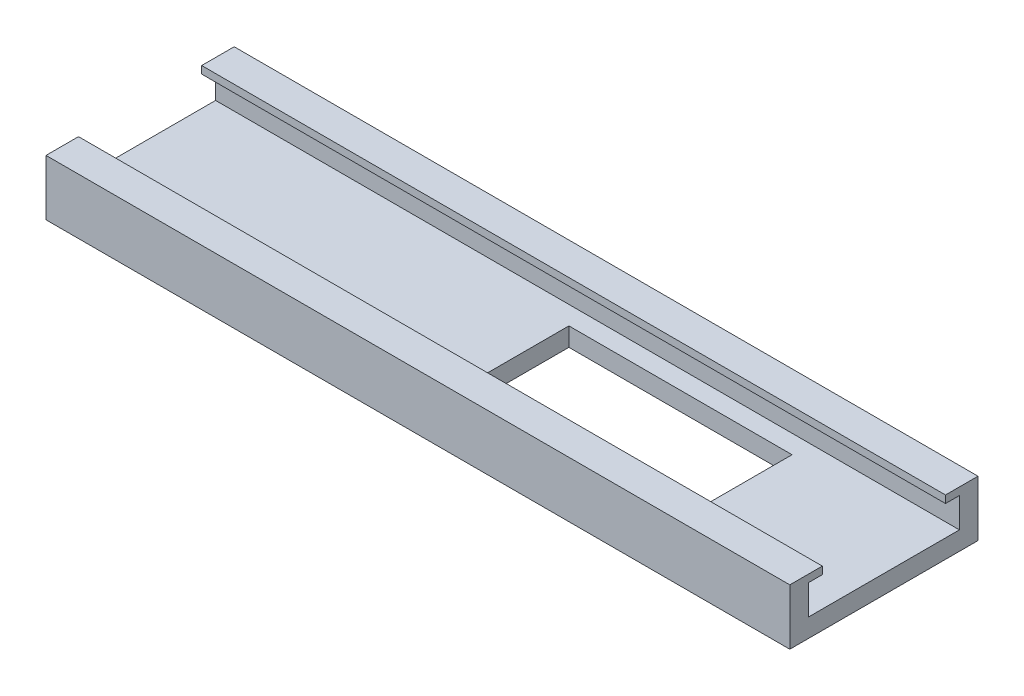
ISO-10303-21;
HEADER;
FILE_DESCRIPTION(('STEP AP214'),'2;1');
FILE_NAME('part.step','',(''),(''),'','','');
FILE_SCHEMA(('AUTOMOTIVE_DESIGN { 1 0 10303 214 1 1 1 1 }'));
ENDSEC;
DATA;
#1=APPLICATION_CONTEXT('core data for automotive mechanical design processes');
#2=APPLICATION_PROTOCOL_DEFINITION('international standard','automotive_design',2000,#1);
#3=PRODUCT_CONTEXT('',#1,'mechanical');
#4=PRODUCT('Part','Part','',(#3));
#5=PRODUCT_RELATED_PRODUCT_CATEGORY('part','',(#4));
#6=PRODUCT_DEFINITION_FORMATION('','',#4);
#7=PRODUCT_DEFINITION_CONTEXT('part definition',#1,'design');
#8=PRODUCT_DEFINITION('design','',#6,#7);
#9=PRODUCT_DEFINITION_SHAPE('','',#8);
#10=(LENGTH_UNIT() NAMED_UNIT(*) SI_UNIT(.MILLI.,.METRE.));
#11=(NAMED_UNIT(*) PLANE_ANGLE_UNIT() SI_UNIT($,.RADIAN.));
#12=(NAMED_UNIT(*) SI_UNIT($,.STERADIAN.) SOLID_ANGLE_UNIT());
#13=UNCERTAINTY_MEASURE_WITH_UNIT(LENGTH_MEASURE(1.E-05),#10,'distance_accuracy_value','');
#14=(GEOMETRIC_REPRESENTATION_CONTEXT(3) GLOBAL_UNCERTAINTY_ASSIGNED_CONTEXT((#13)) GLOBAL_UNIT_ASSIGNED_CONTEXT((#10,
#11,#12)) REPRESENTATION_CONTEXT('',''));
#15=CARTESIAN_POINT('',(0.,0.,0.));
#16=DIRECTION('',(0.,0.,1.));
#17=DIRECTION('',(1.,0.,0.));
#18=AXIS2_PLACEMENT_3D('',#15,#16,#17);
#19=CARTESIAN_POINT('',(254.,19.05,0.));
#20=DIRECTION('',(0.,0.,-1.));
#21=DIRECTION('',(0.,1.,0.));
#22=AXIS2_PLACEMENT_3D('',#19,#20,#21);
#23=PLANE('',#22);
#24=DIRECTION('',(0.,-1.,0.));
#25=VECTOR('',#24,1.);
#26=CARTESIAN_POINT('',(0.,19.05,0.));
#27=LINE('',#26,#25);
#28=CARTESIAN_POINT('',(0.,19.05,0.));
#29=VERTEX_POINT('',#28);
#30=CARTESIAN_POINT('',(0.,0.,0.));
#31=VERTEX_POINT('',#30);
#32=EDGE_CURVE('E178',#29,#31,#27,.T.);
#33=ORIENTED_EDGE('',*,*,#32,.T.);
#34=DIRECTION('',(-1.,0.,0.));
#35=VECTOR('',#34,1.);
#36=CARTESIAN_POINT('',(254.,0.,0.));
#37=LINE('',#36,#35);
#38=CARTESIAN_POINT('',(254.,0.,0.));
#39=VERTEX_POINT('',#38);
#40=EDGE_CURVE('E11',#39,#31,#37,.T.);
#41=ORIENTED_EDGE('',*,*,#40,.F.);
#42=DIRECTION('',(0.,-1.,0.));
#43=VECTOR('',#42,1.);
#44=CARTESIAN_POINT('',(254.,19.05,0.));
#45=LINE('',#44,#43);
#46=CARTESIAN_POINT('',(254.,19.05,0.));
#47=VERTEX_POINT('',#46);
#48=EDGE_CURVE('E182',#47,#39,#45,.T.);
#49=ORIENTED_EDGE('',*,*,#48,.F.);
#50=DIRECTION('',(-1.,0.,0.));
#51=VECTOR('',#50,1.);
#52=CARTESIAN_POINT('',(254.,19.05,0.));
#53=LINE('',#52,#51);
#54=EDGE_CURVE('E208',#47,#29,#53,.T.);
#55=ORIENTED_EDGE('',*,*,#54,.T.);
#56=EDGE_LOOP('',(#33,#41,#49,#55));
#57=FACE_BOUND('',#56,.T.);
#58=ADVANCED_FACE('F33',(#57),#23,.F.);
#59=CARTESIAN_POINT('',(254.,0.,0.));
#60=DIRECTION('',(0.,1.,0.));
#61=DIRECTION('',(0.,0.,1.));
#62=AXIS2_PLACEMENT_3D('',#59,#60,#61);
#63=PLANE('',#62);
#64=DIRECTION('',(-1.,0.,0.));
#65=VECTOR('',#64,1.);
#66=CARTESIAN_POINT('',(127.,0.,-51.562));
#67=LINE('',#66,#65);
#68=CARTESIAN_POINT('',(203.2,0.,-51.562));
#69=VERTEX_POINT('',#68);
#70=CARTESIAN_POINT('',(127.,0.,-51.562));
#71=VERTEX_POINT('',#70);
#72=EDGE_CURVE('E153',#69,#71,#67,.T.);
#73=ORIENTED_EDGE('',*,*,#72,.T.);
#74=DIRECTION('',(0.,0.,1.));
#75=VECTOR('',#74,1.);
#76=CARTESIAN_POINT('',(127.,0.,-13.462));
#77=LINE('',#76,#75);
#78=CARTESIAN_POINT('',(127.,0.,-13.462));
#79=VERTEX_POINT('',#78);
#80=EDGE_CURVE('E147',#71,#79,#77,.T.);
#81=ORIENTED_EDGE('',*,*,#80,.T.);
#82=DIRECTION('',(1.,0.,0.));
#83=VECTOR('',#82,1.);
#84=CARTESIAN_POINT('',(127.,0.,-13.462));
#85=LINE('',#84,#83);
#86=CARTESIAN_POINT('',(203.2,0.,-13.462));
#87=VERTEX_POINT('',#86);
#88=EDGE_CURVE('E156',#79,#87,#85,.T.);
#89=ORIENTED_EDGE('',*,*,#88,.T.);
#90=DIRECTION('',(0.,0.,-1.));
#91=VECTOR('',#90,1.);
#92=CARTESIAN_POINT('',(203.2,0.,-13.462));
#93=LINE('',#92,#91);
#94=EDGE_CURVE('E47',#87,#69,#93,.T.);
#95=ORIENTED_EDGE('',*,*,#94,.T.);
#96=EDGE_LOOP('',(#73,#81,#89,#95));
#97=FACE_BOUND('',#96,.T.);
#98=DIRECTION('',(0.,0.,-1.));
#99=VECTOR('',#98,1.);
#100=CARTESIAN_POINT('',(0.,0.,0.));
#101=LINE('',#100,#99);
#102=CARTESIAN_POINT('',(0.,0.,-64.262));
#103=VERTEX_POINT('',#102);
#104=EDGE_CURVE('E211',#31,#103,#101,.T.);
#105=ORIENTED_EDGE('',*,*,#104,.T.);
#106=DIRECTION('',(-1.,0.,0.));
#107=VECTOR('',#106,1.);
#108=CARTESIAN_POINT('',(254.,0.,-64.262));
#109=LINE('',#108,#107);
#110=CARTESIAN_POINT('',(254.,0.,-64.262));
#111=VERTEX_POINT('',#110);
#112=EDGE_CURVE('E40',#111,#103,#109,.T.);
#113=ORIENTED_EDGE('',*,*,#112,.F.);
#114=DIRECTION('',(0.,0.,-1.));
#115=VECTOR('',#114,1.);
#116=CARTESIAN_POINT('',(254.,0.,0.));
#117=LINE('',#116,#115);
#118=EDGE_CURVE('E185',#39,#111,#117,.T.);
#119=ORIENTED_EDGE('',*,*,#118,.F.);
#120=ORIENTED_EDGE('',*,*,#40,.T.);
#121=EDGE_LOOP('',(#105,#113,#119,#120));
#122=FACE_BOUND('',#121,.T.);
#123=ADVANCED_FACE('F160',(#97,#122),#63,.F.);
#124=CARTESIAN_POINT('',(254.,0.,-64.262));
#125=DIRECTION('',(0.,0.,1.));
#126=DIRECTION('',(1.,0.,0.));
#127=AXIS2_PLACEMENT_3D('',#124,#125,#126);
#128=PLANE('',#127);
#129=DIRECTION('',(0.,1.,0.));
#130=VECTOR('',#129,1.);
#131=CARTESIAN_POINT('',(0.,0.,-64.262));
#132=LINE('',#131,#130);
#133=CARTESIAN_POINT('',(0.,19.05,-64.262));
#134=VERTEX_POINT('',#133);
#135=EDGE_CURVE('E213',#103,#134,#132,.T.);
#136=ORIENTED_EDGE('',*,*,#135,.T.);
#137=DIRECTION('',(-1.,0.,0.));
#138=VECTOR('',#137,1.);
#139=CARTESIAN_POINT('',(254.,19.05,-64.262));
#140=LINE('',#139,#138);
#141=CARTESIAN_POINT('',(254.,19.05,-64.262));
#142=VERTEX_POINT('',#141);
#143=EDGE_CURVE('E258',#142,#134,#140,.T.);
#144=ORIENTED_EDGE('',*,*,#143,.F.);
#145=DIRECTION('',(0.,1.,0.));
#146=VECTOR('',#145,1.);
#147=CARTESIAN_POINT('',(254.,0.,-64.262));
#148=LINE('',#147,#146);
#149=EDGE_CURVE('E188',#111,#142,#148,.T.);
#150=ORIENTED_EDGE('',*,*,#149,.F.);
#151=ORIENTED_EDGE('',*,*,#112,.T.);
#152=EDGE_LOOP('',(#136,#144,#150,#151));
#153=FACE_BOUND('',#152,.T.);
#154=ADVANCED_FACE('F265',(#153),#128,.F.);
#155=CARTESIAN_POINT('',(254.,19.05,-64.262));
#156=DIRECTION('',(0.,-1.,0.));
#157=DIRECTION('',(0.,0.,-1.));
#158=AXIS2_PLACEMENT_3D('',#155,#156,#157);
#159=PLANE('',#158);
#160=DIRECTION('',(0.,0.,1.));
#161=VECTOR('',#160,1.);
#162=CARTESIAN_POINT('',(0.,19.05,-64.262));
#163=LINE('',#162,#161);
#164=CARTESIAN_POINT('',(0.,19.05,-53.1622));
#165=VERTEX_POINT('',#164);
#166=EDGE_CURVE('E215',#134,#165,#163,.T.);
#167=ORIENTED_EDGE('',*,*,#166,.T.);
#168=DIRECTION('',(-1.,0.,0.));
#169=VECTOR('',#168,1.);
#170=CARTESIAN_POINT('',(254.,19.05,-53.1622));
#171=LINE('',#170,#169);
#172=CARTESIAN_POINT('',(254.,19.05,-53.1622));
#173=VERTEX_POINT('',#172);
#174=EDGE_CURVE('E255',#173,#165,#171,.T.);
#175=ORIENTED_EDGE('',*,*,#174,.F.);
#176=DIRECTION('',(0.,0.,1.));
#177=VECTOR('',#176,1.);
#178=CARTESIAN_POINT('',(254.,19.05,-64.262));
#179=LINE('',#178,#177);
#180=EDGE_CURVE('E190',#142,#173,#179,.T.);
#181=ORIENTED_EDGE('',*,*,#180,.F.);
#182=ORIENTED_EDGE('',*,*,#143,.T.);
#183=EDGE_LOOP('',(#167,#175,#181,#182));
#184=FACE_BOUND('',#183,.T.);
#185=ADVANCED_FACE('F275',(#184),#159,.F.);
#186=CARTESIAN_POINT('',(254.,19.05,-53.1622));
#187=DIRECTION('',(0.,0.,-1.));
#188=DIRECTION('',(-1.,0.,0.));
#189=AXIS2_PLACEMENT_3D('',#186,#187,#188);
#190=PLANE('',#189);
#191=DIRECTION('',(0.,-1.,0.));
#192=VECTOR('',#191,1.);
#193=CARTESIAN_POINT('',(0.,19.05,-53.1622));
#194=LINE('',#193,#192);
#195=CARTESIAN_POINT('',(0.,16.51,-53.1622));
#196=VERTEX_POINT('',#195);
#197=EDGE_CURVE('E217',#165,#196,#194,.T.);
#198=ORIENTED_EDGE('',*,*,#197,.T.);
#199=DIRECTION('',(-1.,0.,0.));
#200=VECTOR('',#199,1.);
#201=CARTESIAN_POINT('',(254.,16.51,-53.1622));
#202=LINE('',#201,#200);
#203=CARTESIAN_POINT('',(254.,16.51,-53.1622));
#204=VERTEX_POINT('',#203);
#205=EDGE_CURVE('E252',#204,#196,#202,.T.);
#206=ORIENTED_EDGE('',*,*,#205,.F.);
#207=DIRECTION('',(0.,-1.,0.));
#208=VECTOR('',#207,1.);
#209=CARTESIAN_POINT('',(254.,19.05,-53.1622));
#210=LINE('',#209,#208);
#211=EDGE_CURVE('E192',#173,#204,#210,.T.);
#212=ORIENTED_EDGE('',*,*,#211,.F.);
#213=ORIENTED_EDGE('',*,*,#174,.T.);
#214=EDGE_LOOP('',(#198,#206,#212,#213));
#215=FACE_BOUND('',#214,.T.);
#216=ADVANCED_FACE('F279',(#215),#190,.F.);
#217=CARTESIAN_POINT('',(254.,16.51,-53.1622));
#218=DIRECTION('',(0.,1.,0.));
#219=DIRECTION('',(0.,0.,1.));
#220=AXIS2_PLACEMENT_3D('',#217,#218,#219);
#221=PLANE('',#220);
#222=DIRECTION('',(0.,0.,-1.));
#223=VECTOR('',#222,1.);
#224=CARTESIAN_POINT('',(0.,16.51,-53.1622));
#225=LINE('',#224,#223);
#226=CARTESIAN_POINT('',(0.,16.51,-57.912));
#227=VERTEX_POINT('',#226);
#228=EDGE_CURVE('E219',#196,#227,#225,.T.);
#229=ORIENTED_EDGE('',*,*,#228,.T.);
#230=DIRECTION('',(-1.,0.,0.));
#231=VECTOR('',#230,1.);
#232=CARTESIAN_POINT('',(254.,16.51,-57.912));
#233=LINE('',#232,#231);
#234=CARTESIAN_POINT('',(254.,16.51,-57.912));
#235=VERTEX_POINT('',#234);
#236=EDGE_CURVE('E249',#235,#227,#233,.T.);
#237=ORIENTED_EDGE('',*,*,#236,.F.);
#238=DIRECTION('',(0.,0.,-1.));
#239=VECTOR('',#238,1.);
#240=CARTESIAN_POINT('',(254.,16.51,-53.1622));
#241=LINE('',#240,#239);
#242=EDGE_CURVE('E194',#204,#235,#241,.T.);
#243=ORIENTED_EDGE('',*,*,#242,.F.);
#244=ORIENTED_EDGE('',*,*,#205,.T.);
#245=EDGE_LOOP('',(#229,#237,#243,#244));
#246=FACE_BOUND('',#245,.T.);
#247=ADVANCED_FACE('F319',(#246),#221,.F.);
#248=CARTESIAN_POINT('',(254.,16.51,-57.912));
#249=DIRECTION('',(0.,0.,-1.));
#250=DIRECTION('',(-1.,0.,0.));
#251=AXIS2_PLACEMENT_3D('',#248,#249,#250);
#252=PLANE('',#251);
#253=DIRECTION('',(0.,-1.,0.));
#254=VECTOR('',#253,1.);
#255=CARTESIAN_POINT('',(0.,16.51,-57.912));
#256=LINE('',#255,#254);
#257=CARTESIAN_POINT('',(0.,6.35,-57.912));
#258=VERTEX_POINT('',#257);
#259=EDGE_CURVE('E221',#227,#258,#256,.T.);
#260=ORIENTED_EDGE('',*,*,#259,.T.);
#261=DIRECTION('',(-1.,0.,0.));
#262=VECTOR('',#261,1.);
#263=CARTESIAN_POINT('',(254.,6.35,-57.912));
#264=LINE('',#263,#262);
#265=CARTESIAN_POINT('',(254.,6.35,-57.912));
#266=VERTEX_POINT('',#265);
#267=EDGE_CURVE('E246',#266,#258,#264,.T.);
#268=ORIENTED_EDGE('',*,*,#267,.F.);
#269=DIRECTION('',(0.,-1.,0.));
#270=VECTOR('',#269,1.);
#271=CARTESIAN_POINT('',(254.,16.51,-57.912));
#272=LINE('',#271,#270);
#273=EDGE_CURVE('E196',#235,#266,#272,.T.);
#274=ORIENTED_EDGE('',*,*,#273,.F.);
#275=ORIENTED_EDGE('',*,*,#236,.T.);
#276=EDGE_LOOP('',(#260,#268,#274,#275));
#277=FACE_BOUND('',#276,.T.);
#278=ADVANCED_FACE('F317',(#277),#252,.F.);
#279=CARTESIAN_POINT('',(254.,6.35,-57.912));
#280=DIRECTION('',(0.,-1.,0.));
#281=DIRECTION('',(0.,0.,-1.));
#282=AXIS2_PLACEMENT_3D('',#279,#280,#281);
#283=PLANE('',#282);
#284=DIRECTION('',(1.,0.,0.));
#285=VECTOR('',#284,1.);
#286=CARTESIAN_POINT('',(127.,6.34999999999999,-13.462));
#287=LINE('',#286,#285);
#288=CARTESIAN_POINT('',(127.,6.34999999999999,-13.462));
#289=VERTEX_POINT('',#288);
#290=CARTESIAN_POINT('',(203.2,6.34999999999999,-13.462));
#291=VERTEX_POINT('',#290);
#292=EDGE_CURVE('E172',#289,#291,#287,.T.);
#293=ORIENTED_EDGE('',*,*,#292,.F.);
#294=DIRECTION('',(0.,0.,1.));
#295=VECTOR('',#294,1.);
#296=CARTESIAN_POINT('',(127.,6.34999999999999,-13.462));
#297=LINE('',#296,#295);
#298=CARTESIAN_POINT('',(127.,6.35,-51.562));
#299=VERTEX_POINT('',#298);
#300=EDGE_CURVE('E55',#299,#289,#297,.T.);
#301=ORIENTED_EDGE('',*,*,#300,.F.);
#302=DIRECTION('',(-1.,0.,0.));
#303=VECTOR('',#302,1.);
#304=CARTESIAN_POINT('',(127.,6.35,-51.562));
#305=LINE('',#304,#303);
#306=CARTESIAN_POINT('',(203.2,6.35,-51.562));
#307=VERTEX_POINT('',#306);
#308=EDGE_CURVE('E163',#307,#299,#305,.T.);
#309=ORIENTED_EDGE('',*,*,#308,.F.);
#310=DIRECTION('',(0.,0.,-1.));
#311=VECTOR('',#310,1.);
#312=CARTESIAN_POINT('',(203.2,6.34999999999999,-13.462));
#313=LINE('',#312,#311);
#314=EDGE_CURVE('E166',#291,#307,#313,.T.);
#315=ORIENTED_EDGE('',*,*,#314,.F.);
#316=EDGE_LOOP('',(#293,#301,#309,#315));
#317=FACE_BOUND('',#316,.T.);
#318=DIRECTION('',(0.,0.,1.));
#319=VECTOR('',#318,1.);
#320=CARTESIAN_POINT('',(0.,6.35,-57.912));
#321=LINE('',#320,#319);
#322=CARTESIAN_POINT('',(0.,6.34999999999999,-6.35));
#323=VERTEX_POINT('',#322);
#324=EDGE_CURVE('E223',#258,#323,#321,.T.);
#325=ORIENTED_EDGE('',*,*,#324,.T.);
#326=DIRECTION('',(-1.,0.,0.));
#327=VECTOR('',#326,1.);
#328=CARTESIAN_POINT('',(254.,6.34999999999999,-6.35));
#329=LINE('',#328,#327);
#330=CARTESIAN_POINT('',(254.,6.34999999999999,-6.35));
#331=VERTEX_POINT('',#330);
#332=EDGE_CURVE('E243',#331,#323,#329,.T.);
#333=ORIENTED_EDGE('',*,*,#332,.F.);
#334=DIRECTION('',(0.,0.,1.));
#335=VECTOR('',#334,1.);
#336=CARTESIAN_POINT('',(254.,6.35,-57.912));
#337=LINE('',#336,#335);
#338=EDGE_CURVE('E198',#266,#331,#337,.T.);
#339=ORIENTED_EDGE('',*,*,#338,.F.);
#340=ORIENTED_EDGE('',*,*,#267,.T.);
#341=EDGE_LOOP('',(#325,#333,#339,#340));
#342=FACE_BOUND('',#341,.T.);
#343=ADVANCED_FACE('F313',(#317,#342),#283,.F.);
#344=CARTESIAN_POINT('',(254.,6.34999999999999,-6.35));
#345=DIRECTION('',(0.,0.,1.));
#346=DIRECTION('',(1.,0.,0.));
#347=AXIS2_PLACEMENT_3D('',#344,#345,#346);
#348=PLANE('',#347);
#349=DIRECTION('',(0.,1.,0.));
#350=VECTOR('',#349,1.);
#351=CARTESIAN_POINT('',(0.,6.34999999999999,-6.35));
#352=LINE('',#351,#350);
#353=CARTESIAN_POINT('',(0.,16.51,-6.35));
#354=VERTEX_POINT('',#353);
#355=EDGE_CURVE('E225',#323,#354,#352,.T.);
#356=ORIENTED_EDGE('',*,*,#355,.T.);
#357=DIRECTION('',(-1.,0.,0.));
#358=VECTOR('',#357,1.);
#359=CARTESIAN_POINT('',(254.,16.51,-6.35));
#360=LINE('',#359,#358);
#361=CARTESIAN_POINT('',(254.,16.51,-6.35));
#362=VERTEX_POINT('',#361);
#363=EDGE_CURVE('E240',#362,#354,#360,.T.);
#364=ORIENTED_EDGE('',*,*,#363,.F.);
#365=DIRECTION('',(0.,1.,0.));
#366=VECTOR('',#365,1.);
#367=CARTESIAN_POINT('',(254.,6.34999999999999,-6.35));
#368=LINE('',#367,#366);
#369=EDGE_CURVE('E200',#331,#362,#368,.T.);
#370=ORIENTED_EDGE('',*,*,#369,.F.);
#371=ORIENTED_EDGE('',*,*,#332,.T.);
#372=EDGE_LOOP('',(#356,#364,#370,#371));
#373=FACE_BOUND('',#372,.T.);
#374=ADVANCED_FACE('F308',(#373),#348,.F.);
#375=CARTESIAN_POINT('',(254.,16.51,-6.35));
#376=DIRECTION('',(0.,1.,0.));
#377=DIRECTION('',(0.,0.,1.));
#378=AXIS2_PLACEMENT_3D('',#375,#376,#377);
#379=PLANE('',#378);
#380=DIRECTION('',(0.,0.,-1.));
#381=VECTOR('',#380,1.);
#382=CARTESIAN_POINT('',(0.,16.51,-6.35));
#383=LINE('',#382,#381);
#384=CARTESIAN_POINT('',(0.,16.51,-11.0998));
#385=VERTEX_POINT('',#384);
#386=EDGE_CURVE('E227',#354,#385,#383,.T.);
#387=ORIENTED_EDGE('',*,*,#386,.T.);
#388=DIRECTION('',(-1.,0.,0.));
#389=VECTOR('',#388,1.);
#390=CARTESIAN_POINT('',(254.,16.51,-11.0998));
#391=LINE('',#390,#389);
#392=CARTESIAN_POINT('',(254.,16.51,-11.0998));
#393=VERTEX_POINT('',#392);
#394=EDGE_CURVE('E237',#393,#385,#391,.T.);
#395=ORIENTED_EDGE('',*,*,#394,.F.);
#396=DIRECTION('',(0.,0.,-1.));
#397=VECTOR('',#396,1.);
#398=CARTESIAN_POINT('',(254.,16.51,-6.35));
#399=LINE('',#398,#397);
#400=EDGE_CURVE('E202',#362,#393,#399,.T.);
#401=ORIENTED_EDGE('',*,*,#400,.F.);
#402=ORIENTED_EDGE('',*,*,#363,.T.);
#403=EDGE_LOOP('',(#387,#395,#401,#402));
#404=FACE_BOUND('',#403,.T.);
#405=ADVANCED_FACE('F302',(#404),#379,.F.);
#406=CARTESIAN_POINT('',(254.,16.51,-11.0998));
#407=DIRECTION('',(0.,0.,1.));
#408=DIRECTION('',(0.,-1.,0.));
#409=AXIS2_PLACEMENT_3D('',#406,#407,#408);
#410=PLANE('',#409);
#411=DIRECTION('',(0.,1.,0.));
#412=VECTOR('',#411,1.);
#413=CARTESIAN_POINT('',(0.,16.51,-11.0998));
#414=LINE('',#413,#412);
#415=CARTESIAN_POINT('',(0.,19.05,-11.0998));
#416=VERTEX_POINT('',#415);
#417=EDGE_CURVE('E229',#385,#416,#414,.T.);
#418=ORIENTED_EDGE('',*,*,#417,.T.);
#419=DIRECTION('',(-1.,0.,0.));
#420=VECTOR('',#419,1.);
#421=CARTESIAN_POINT('',(254.,19.05,-11.0998));
#422=LINE('',#421,#420);
#423=CARTESIAN_POINT('',(254.,19.05,-11.0998));
#424=VERTEX_POINT('',#423);
#425=EDGE_CURVE('E234',#424,#416,#422,.T.);
#426=ORIENTED_EDGE('',*,*,#425,.F.);
#427=DIRECTION('',(0.,1.,0.));
#428=VECTOR('',#427,1.);
#429=CARTESIAN_POINT('',(254.,16.51,-11.0998));
#430=LINE('',#429,#428);
#431=EDGE_CURVE('E204',#393,#424,#430,.T.);
#432=ORIENTED_EDGE('',*,*,#431,.F.);
#433=ORIENTED_EDGE('',*,*,#394,.T.);
#434=EDGE_LOOP('',(#418,#426,#432,#433));
#435=FACE_BOUND('',#434,.T.);
#436=ADVANCED_FACE('F298',(#435),#410,.F.);
#437=CARTESIAN_POINT('',(254.,19.05,-11.0998));
#438=DIRECTION('',(0.,-1.,0.));
#439=DIRECTION('',(0.,0.,-1.));
#440=AXIS2_PLACEMENT_3D('',#437,#438,#439);
#441=PLANE('',#440);
#442=DIRECTION('',(0.,0.,1.));
#443=VECTOR('',#442,1.);
#444=CARTESIAN_POINT('',(0.,19.05,-11.0998));
#445=LINE('',#444,#443);
#446=EDGE_CURVE('E186',#416,#29,#445,.T.);
#447=ORIENTED_EDGE('',*,*,#446,.T.);
#448=ORIENTED_EDGE('',*,*,#54,.F.);
#449=DIRECTION('',(0.,0.,1.));
#450=VECTOR('',#449,1.);
#451=CARTESIAN_POINT('',(254.,19.05,-11.0998));
#452=LINE('',#451,#450);
#453=EDGE_CURVE('E206',#424,#47,#452,.T.);
#454=ORIENTED_EDGE('',*,*,#453,.F.);
#455=ORIENTED_EDGE('',*,*,#425,.T.);
#456=EDGE_LOOP('',(#447,#448,#454,#455));
#457=FACE_BOUND('',#456,.T.);
#458=ADVANCED_FACE('F293',(#457),#441,.F.);
#459=CARTESIAN_POINT('',(254.,0.,0.));
#460=DIRECTION('',(1.,0.,0.));
#461=DIRECTION('',(0.,0.,-1.));
#462=AXIS2_PLACEMENT_3D('',#459,#460,#461);
#463=PLANE('',#462);
#464=ORIENTED_EDGE('',*,*,#48,.T.);
#465=ORIENTED_EDGE('',*,*,#118,.T.);
#466=ORIENTED_EDGE('',*,*,#149,.T.);
#467=ORIENTED_EDGE('',*,*,#180,.T.);
#468=ORIENTED_EDGE('',*,*,#211,.T.);
#469=ORIENTED_EDGE('',*,*,#242,.T.);
#470=ORIENTED_EDGE('',*,*,#273,.T.);
#471=ORIENTED_EDGE('',*,*,#338,.T.);
#472=ORIENTED_EDGE('',*,*,#369,.T.);
#473=ORIENTED_EDGE('',*,*,#400,.T.);
#474=ORIENTED_EDGE('',*,*,#431,.T.);
#475=ORIENTED_EDGE('',*,*,#453,.T.);
#476=EDGE_LOOP('',(#464,#465,#466,#467,#468,#469,#470,#471,#472,#473,#474,#475));
#477=FACE_BOUND('',#476,.T.);
#478=ADVANCED_FACE('F283',(#477),#463,.T.);
#479=CARTESIAN_POINT('',(0.,0.,0.));
#480=DIRECTION('',(1.,0.,0.));
#481=DIRECTION('',(0.,0.,-1.));
#482=AXIS2_PLACEMENT_3D('',#479,#480,#481);
#483=PLANE('',#482);
#484=ORIENTED_EDGE('',*,*,#32,.F.);
#485=ORIENTED_EDGE('',*,*,#446,.F.);
#486=ORIENTED_EDGE('',*,*,#417,.F.);
#487=ORIENTED_EDGE('',*,*,#386,.F.);
#488=ORIENTED_EDGE('',*,*,#355,.F.);
#489=ORIENTED_EDGE('',*,*,#324,.F.);
#490=ORIENTED_EDGE('',*,*,#259,.F.);
#491=ORIENTED_EDGE('',*,*,#228,.F.);
#492=ORIENTED_EDGE('',*,*,#197,.F.);
#493=ORIENTED_EDGE('',*,*,#166,.F.);
#494=ORIENTED_EDGE('',*,*,#135,.F.);
#495=ORIENTED_EDGE('',*,*,#104,.F.);
#496=EDGE_LOOP('',(#484,#485,#486,#487,#488,#489,#490,#491,#492,#493,#494,#495));
#497=FACE_BOUND('',#496,.T.);
#498=ADVANCED_FACE('F270',(#497),#483,.F.);
#499=CARTESIAN_POINT('',(127.,0.,-13.462));
#500=DIRECTION('',(-1.,0.,0.));
#501=DIRECTION('',(0.,0.,1.));
#502=AXIS2_PLACEMENT_3D('',#499,#500,#501);
#503=PLANE('',#502);
#504=ORIENTED_EDGE('',*,*,#300,.T.);
#505=DIRECTION('',(0.,1.,0.));
#506=VECTOR('',#505,1.);
#507=CARTESIAN_POINT('',(127.,0.,-13.462));
#508=LINE('',#507,#506);
#509=EDGE_CURVE('E143',#79,#289,#508,.T.);
#510=ORIENTED_EDGE('',*,*,#509,.F.);
#511=ORIENTED_EDGE('',*,*,#80,.F.);
#512=DIRECTION('',(0.,1.,0.));
#513=VECTOR('',#512,1.);
#514=CARTESIAN_POINT('',(127.,0.,-51.562));
#515=LINE('',#514,#513);
#516=EDGE_CURVE('E176',#71,#299,#515,.T.);
#517=ORIENTED_EDGE('',*,*,#516,.T.);
#518=EDGE_LOOP('',(#504,#510,#511,#517));
#519=FACE_BOUND('',#518,.T.);
#520=ADVANCED_FACE('F145',(#519),#503,.F.);
#521=CARTESIAN_POINT('',(127.,0.,-51.562));
#522=DIRECTION('',(0.,0.,-1.));
#523=DIRECTION('',(0.,1.,0.));
#524=AXIS2_PLACEMENT_3D('',#521,#522,#523);
#525=PLANE('',#524);
#526=ORIENTED_EDGE('',*,*,#308,.T.);
#527=ORIENTED_EDGE('',*,*,#516,.F.);
#528=ORIENTED_EDGE('',*,*,#72,.F.);
#529=DIRECTION('',(0.,1.,0.));
#530=VECTOR('',#529,1.);
#531=CARTESIAN_POINT('',(203.2,0.,-51.562));
#532=LINE('',#531,#530);
#533=EDGE_CURVE('E179',#69,#307,#532,.T.);
#534=ORIENTED_EDGE('',*,*,#533,.T.);
#535=EDGE_LOOP('',(#526,#527,#528,#534));
#536=FACE_BOUND('',#535,.T.);
#537=ADVANCED_FACE('F416',(#536),#525,.F.);
#538=CARTESIAN_POINT('',(203.2,0.,-13.462));
#539=DIRECTION('',(1.,0.,0.));
#540=DIRECTION('',(0.,0.,-1.));
#541=AXIS2_PLACEMENT_3D('',#538,#539,#540);
#542=PLANE('',#541);
#543=ORIENTED_EDGE('',*,*,#314,.T.);
#544=ORIENTED_EDGE('',*,*,#533,.F.);
#545=ORIENTED_EDGE('',*,*,#94,.F.);
#546=DIRECTION('',(0.,1.,0.));
#547=VECTOR('',#546,1.);
#548=CARTESIAN_POINT('',(203.2,0.,-13.462));
#549=LINE('',#548,#547);
#550=EDGE_CURVE('E152',#87,#291,#549,.T.);
#551=ORIENTED_EDGE('',*,*,#550,.T.);
#552=EDGE_LOOP('',(#543,#544,#545,#551));
#553=FACE_BOUND('',#552,.T.);
#554=ADVANCED_FACE('F422',(#553),#542,.F.);
#555=CARTESIAN_POINT('',(127.,0.,-13.462));
#556=DIRECTION('',(0.,0.,1.));
#557=DIRECTION('',(0.,-1.,0.));
#558=AXIS2_PLACEMENT_3D('',#555,#556,#557);
#559=PLANE('',#558);
#560=ORIENTED_EDGE('',*,*,#292,.T.);
#561=ORIENTED_EDGE('',*,*,#550,.F.);
#562=ORIENTED_EDGE('',*,*,#88,.F.);
#563=ORIENTED_EDGE('',*,*,#509,.T.);
#564=EDGE_LOOP('',(#560,#561,#562,#563));
#565=FACE_BOUND('',#564,.T.);
#566=ADVANCED_FACE('F157',(#565),#559,.F.);
#567=CLOSED_SHELL('',(#58,#123,#154,#185,#216,#247,#278,#343,#374,#405,#436,#458,#478,#498,#520,
#537,#554,#566));
#568=MANIFOLD_SOLID_BREP('B2',#567);
#569=ADVANCED_BREP_SHAPE_REPRESENTATION('',(#18,#568),#14);
#570=SHAPE_DEFINITION_REPRESENTATION(#9,#569);
ENDSEC;
END-ISO-10303-21;
